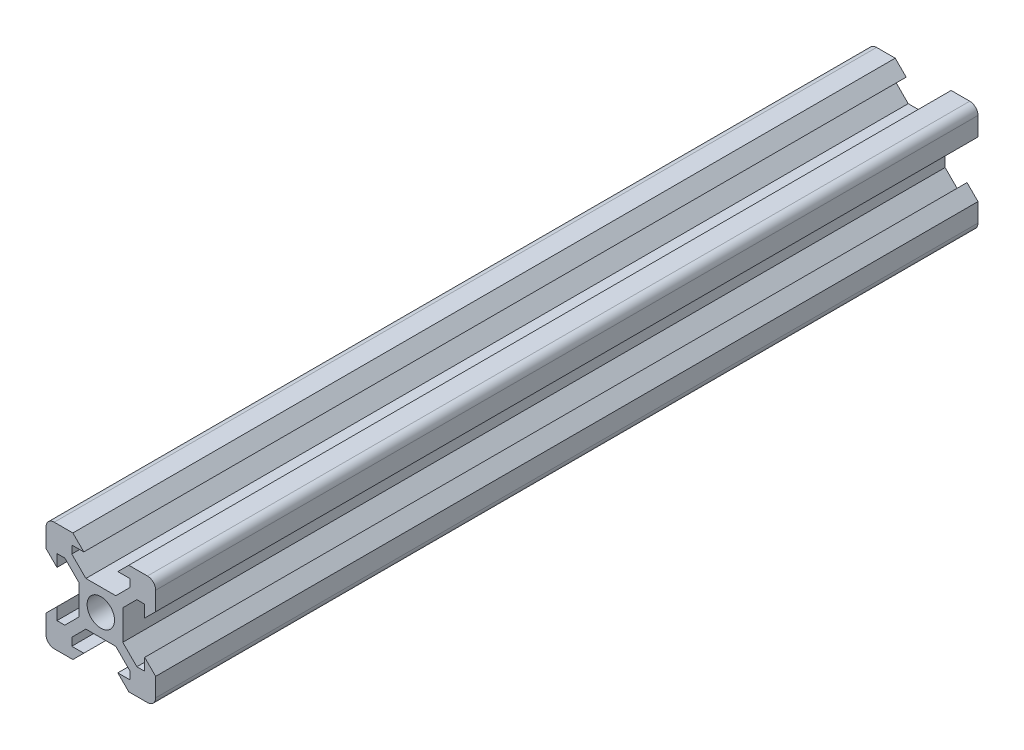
from build123d import *

# Parameters (mm, degrees)
SKETCH_1_R      = 2.5
EXTRUDE_1_DEPTH = 150
FILLET_1_R      = 1.5


with BuildPart() as part:
    # Sketch 1 → Extrude 1 (new body)
    with BuildSketch(Plane.XY):
        Polygon((-2.727207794, 4), (2.727207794, 4), (5.3, 6.572792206), (5.3, 8), (3.1, 8), (5.1, 10), (10, 10), (10, 5.1), (8, 3.1), (8, 5.3), (6.572792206, 5.3), (4, 2.727207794), (4, -2.727207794), (6.572792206, -5.3), (8, -5.3), (8, -3.1), (10, -5.1), (10, -10), (5.1, -10), (3.1, -8), (5.3, -8), (5.3, -6.572792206), (2.727207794, -4), (-2.727207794, -4), (-5.3, -6.572792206), (-5.3, -8), (-3.1, -8), (-5.1, -10), (-10, -10), (-10, -5.1), (-8, -3.1), (-8, -5.3), (-6.572792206, -5.3), (-4, -2.727207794), (-4, 2.727207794), (-6.572792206, 5.3), (-8, 5.3), (-8, 3.1), (-10, 5.1), (-10, 10), (-5.1, 10), (-3.1, 8), (-5.3, 8), (-5.3, 6.572792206), align=None)
        Circle(SKETCH_1_R, mode=Mode.SUBTRACT)
    extrude(amount=EXTRUDE_1_DEPTH)

    # Fillet 1
    fillet_1_edges = [part.edges().sort_by_distance(p)[0] for p in [
        (10, -10, 75),
        (-10, -10, 75),
        (-10, 10, 75),
        (10, 10, 75),
    ]]
    fillet(fillet_1_edges, radius=FILLET_1_R)


solid = part.part
